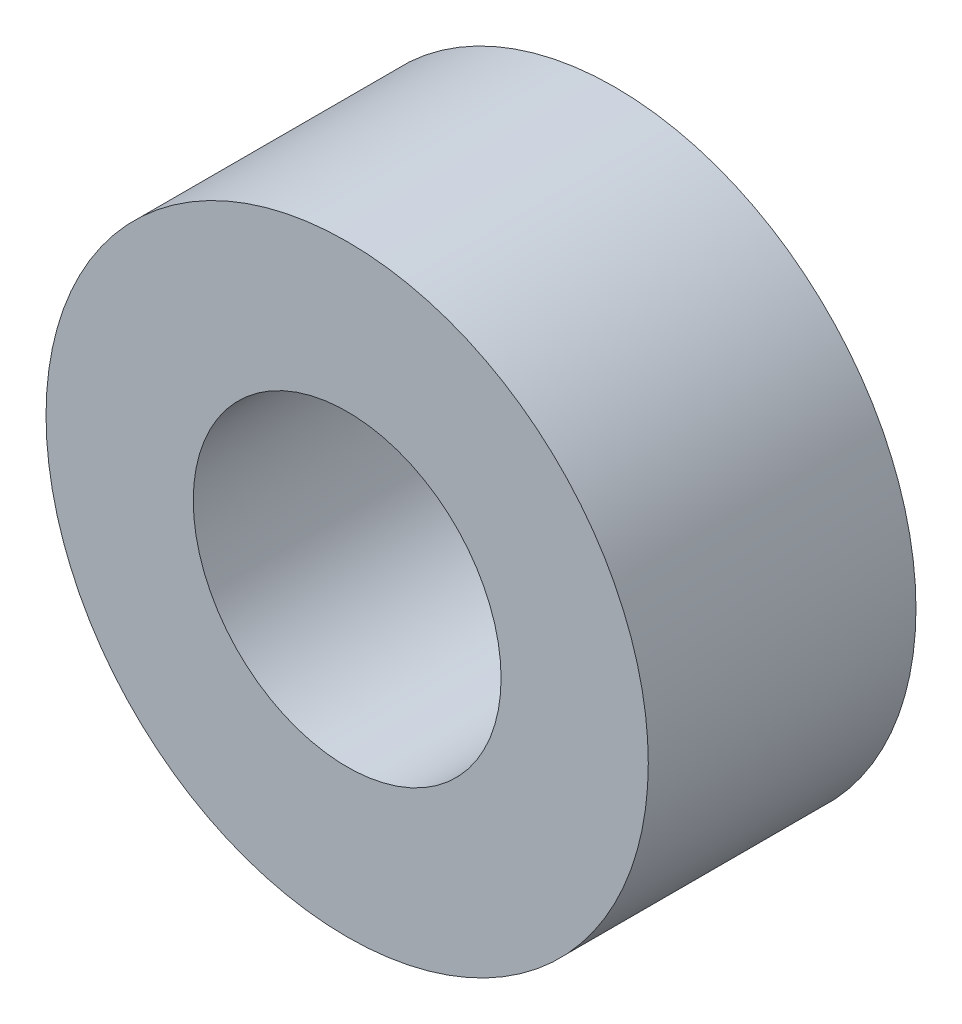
ISO-10303-21;
HEADER;
FILE_DESCRIPTION(('STEP AP214'),'2;1');
FILE_NAME('part.step','',(''),(''),'','','');
FILE_SCHEMA(('AUTOMOTIVE_DESIGN { 1 0 10303 214 1 1 1 1 }'));
ENDSEC;
DATA;
#1=APPLICATION_CONTEXT('core data for automotive mechanical design processes');
#2=APPLICATION_PROTOCOL_DEFINITION('international standard','automotive_design',2000,#1);
#3=PRODUCT_CONTEXT('',#1,'mechanical');
#4=PRODUCT('Part','Part','',(#3));
#5=PRODUCT_RELATED_PRODUCT_CATEGORY('part','',(#4));
#6=PRODUCT_DEFINITION_FORMATION('','',#4);
#7=PRODUCT_DEFINITION_CONTEXT('part definition',#1,'design');
#8=PRODUCT_DEFINITION('design','',#6,#7);
#9=PRODUCT_DEFINITION_SHAPE('','',#8);
#10=(LENGTH_UNIT() NAMED_UNIT(*) SI_UNIT(.MILLI.,.METRE.));
#11=(NAMED_UNIT(*) PLANE_ANGLE_UNIT() SI_UNIT($,.RADIAN.));
#12=(NAMED_UNIT(*) SI_UNIT($,.STERADIAN.) SOLID_ANGLE_UNIT());
#13=UNCERTAINTY_MEASURE_WITH_UNIT(LENGTH_MEASURE(1.E-05),#10,'distance_accuracy_value','');
#14=(GEOMETRIC_REPRESENTATION_CONTEXT(3) GLOBAL_UNCERTAINTY_ASSIGNED_CONTEXT((#13)) GLOBAL_UNIT_ASSIGNED_CONTEXT((#10,
#11,#12)) REPRESENTATION_CONTEXT('',''));
#15=CARTESIAN_POINT('',(0.,0.,0.));
#16=DIRECTION('',(0.,0.,1.));
#17=DIRECTION('',(1.,0.,0.));
#18=AXIS2_PLACEMENT_3D('',#15,#16,#17);
#19=CARTESIAN_POINT('',(0.,0.,8.));
#20=DIRECTION('',(0.,0.,1.));
#21=DIRECTION('',(1.,0.,0.));
#22=AXIS2_PLACEMENT_3D('',#19,#20,#21);
#23=PLANE('',#22);
#24=CARTESIAN_POINT('',(0.,0.,8.));
#25=DIRECTION('',(0.,0.,1.));
#26=DIRECTION('',(1.,0.,0.));
#27=AXIS2_PLACEMENT_3D('',#24,#25,#26);
#28=CIRCLE('',#27,9.);
#29=CARTESIAN_POINT('',(9.,0.,8.));
#30=VERTEX_POINT('',#29);
#31=EDGE_CURVE('E10',#30,#30,#28,.T.);
#32=ORIENTED_EDGE('',*,*,#31,.T.);
#33=EDGE_LOOP('',(#32));
#34=FACE_BOUND('',#33,.T.);
#35=CARTESIAN_POINT('',(0.,0.,8.));
#36=DIRECTION('',(0.,0.,1.));
#37=DIRECTION('',(1.,0.,0.));
#38=AXIS2_PLACEMENT_3D('',#35,#36,#37);
#39=CIRCLE('',#38,4.6);
#40=CARTESIAN_POINT('',(4.6,0.,8.));
#41=VERTEX_POINT('',#40);
#42=EDGE_CURVE('E41',#41,#41,#39,.T.);
#43=ORIENTED_EDGE('',*,*,#42,.F.);
#44=EDGE_LOOP('',(#43));
#45=FACE_BOUND('',#44,.T.);
#46=ADVANCED_FACE('F30',(#34,#45),#23,.T.);
#47=CARTESIAN_POINT('',(0.,0.,0.));
#48=DIRECTION('',(0.,0.,1.));
#49=DIRECTION('',(1.,0.,0.));
#50=AXIS2_PLACEMENT_3D('',#47,#48,#49);
#51=PLANE('',#50);
#52=CARTESIAN_POINT('',(0.,0.,0.));
#53=DIRECTION('',(0.,0.,1.));
#54=DIRECTION('',(1.,0.,0.));
#55=AXIS2_PLACEMENT_3D('',#52,#53,#54);
#56=CIRCLE('',#55,9.);
#57=CARTESIAN_POINT('',(9.,0.,0.));
#58=VERTEX_POINT('',#57);
#59=EDGE_CURVE('E34',#58,#58,#56,.T.);
#60=ORIENTED_EDGE('',*,*,#59,.F.);
#61=EDGE_LOOP('',(#60));
#62=FACE_BOUND('',#61,.T.);
#63=CARTESIAN_POINT('',(0.,0.,0.));
#64=DIRECTION('',(0.,0.,1.));
#65=DIRECTION('',(1.,0.,0.));
#66=AXIS2_PLACEMENT_3D('',#63,#64,#65);
#67=CIRCLE('',#66,4.6);
#68=CARTESIAN_POINT('',(4.6,0.,0.));
#69=VERTEX_POINT('',#68);
#70=EDGE_CURVE('E43',#69,#69,#67,.T.);
#71=ORIENTED_EDGE('',*,*,#70,.T.);
#72=EDGE_LOOP('',(#71));
#73=FACE_BOUND('',#72,.T.);
#74=ADVANCED_FACE('F53',(#62,#73),#51,.F.);
#75=CARTESIAN_POINT('',(0.,0.,8.));
#76=DIRECTION('',(0.,0.,-1.));
#77=DIRECTION('',(-1.,0.,0.));
#78=AXIS2_PLACEMENT_3D('',#75,#76,#77);
#79=CYLINDRICAL_SURFACE('',#78,9.);
#80=ORIENTED_EDGE('',*,*,#31,.F.);
#81=EDGE_LOOP('',(#80));
#82=FACE_BOUND('',#81,.T.);
#83=ORIENTED_EDGE('',*,*,#59,.T.);
#84=EDGE_LOOP('',(#83));
#85=FACE_BOUND('',#84,.T.);
#86=ADVANCED_FACE('F32',(#82,#85),#79,.T.);
#87=CARTESIAN_POINT('',(0.,0.,8.));
#88=DIRECTION('',(0.,0.,-1.));
#89=DIRECTION('',(-1.,0.,0.));
#90=AXIS2_PLACEMENT_3D('',#87,#88,#89);
#91=CYLINDRICAL_SURFACE('',#90,4.6);
#92=ORIENTED_EDGE('',*,*,#42,.T.);
#93=EDGE_LOOP('',(#92));
#94=FACE_BOUND('',#93,.T.);
#95=ORIENTED_EDGE('',*,*,#70,.F.);
#96=EDGE_LOOP('',(#95));
#97=FACE_BOUND('',#96,.T.);
#98=ADVANCED_FACE('F49',(#94,#97),#91,.F.);
#99=CLOSED_SHELL('',(#46,#74,#86,#98));
#100=MANIFOLD_SOLID_BREP('B2',#99);
#101=ADVANCED_BREP_SHAPE_REPRESENTATION('',(#18,#100),#14);
#102=SHAPE_DEFINITION_REPRESENTATION(#9,#101);
ENDSEC;
END-ISO-10303-21;
